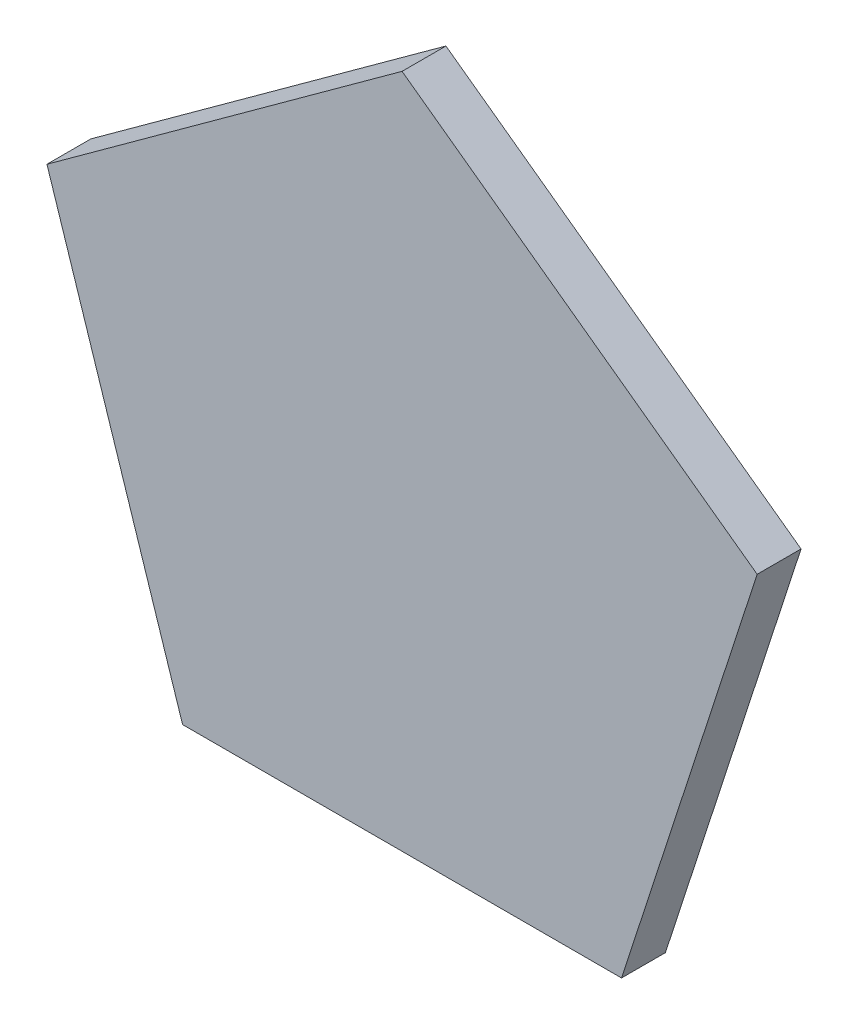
from build123d import *

# Parameters (mm, degrees)
BOSS_EXTRUDE1_DEPTH = 1.27


with BuildPart() as part:
    # Sketch1 → Boss-Extrude1 (new, symmetric)
    with BuildSketch(Plane.XY):
        Polygon((20.549031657, 6.676785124), (0, 21.606530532), (-20.549031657, 6.676785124), (-12.7, -17.48005039), (12.7, -17.48005039), align=None)
    extrude(amount=BOSS_EXTRUDE1_DEPTH, both=True)


solid = part.part
